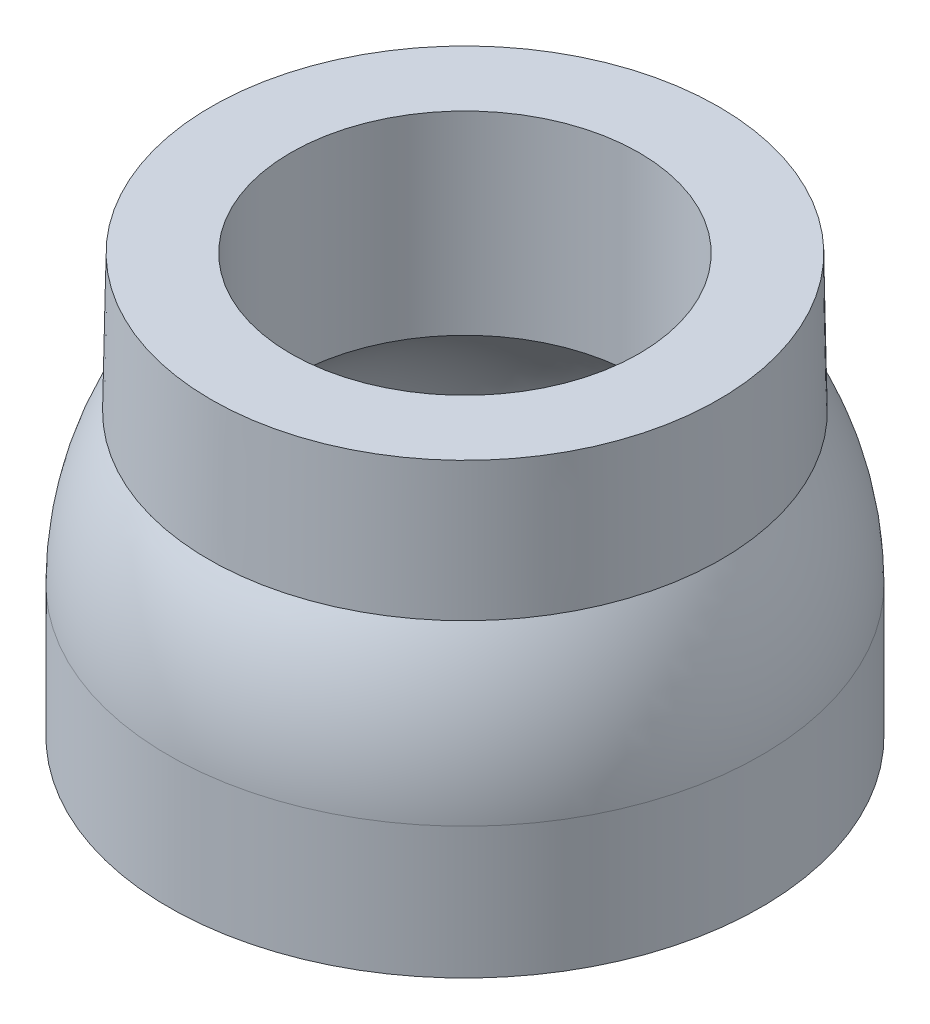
from build123d import *


with BuildPart() as part:
    # Sketch6 → Revolve2 (revolve)
    with BuildSketch(Plane.XY, mode=Mode.PRIVATE) as revolve2_sk:
        with BuildLine():
            Line((7.944904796, 0.242556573), (7.944904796, -1.752727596))
            Line((7.944904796, -1.752727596), (9.844904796, -1.752727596))
            Line((9.844904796, -1.752727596), (9.844904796, 2.64071795))
            ThreePointArc((9.844904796, 2.64071795), (9.504312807, 5.228349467), (8.505737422, 7.639715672))
            Line((8.505737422, 7.639715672), (8.423147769, 12.221962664))
            Line((8.423147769, 12.221962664), (5.763510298, 12.221962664))
            Line((5.763510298, 12.221962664), (5.763510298, 5.732896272))
            ThreePointArc((5.763510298, 5.732896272), (7.37958179, 3.196465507), (7.944904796, 0.242556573))
        make_face()
    revolve(revolve2_sk.sketch.rotate(Axis((-0.055095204, 0.242556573, 0), (0, 1, 0)), 90), axis=Axis((-0.055095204, 0.242556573, 0), (0, 1, 0)))


solid = part.part
